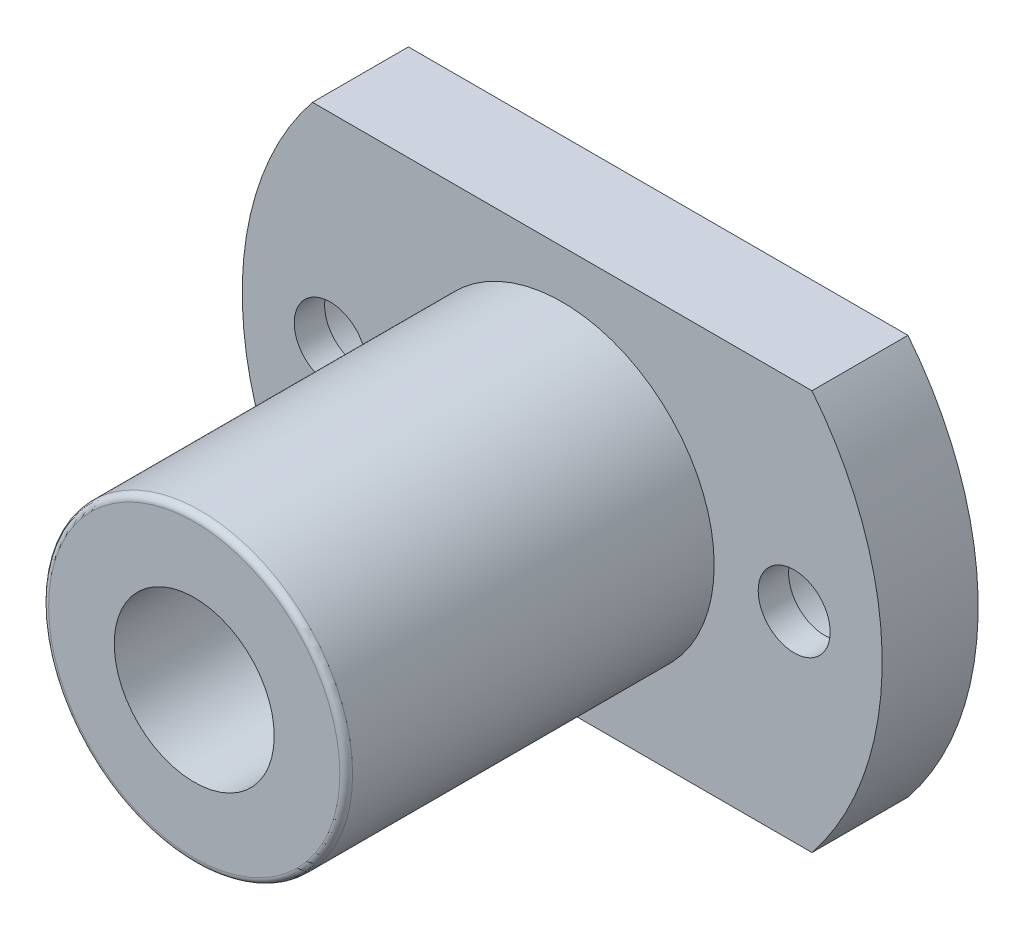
ISO-10303-21;
HEADER;
FILE_DESCRIPTION(('STEP AP214'),'2;1');
FILE_NAME('part.step','',(''),(''),'','','');
FILE_SCHEMA(('AUTOMOTIVE_DESIGN { 1 0 10303 214 1 1 1 1 }'));
ENDSEC;
DATA;
#1=APPLICATION_CONTEXT('core data for automotive mechanical design processes');
#2=APPLICATION_PROTOCOL_DEFINITION('international standard','automotive_design',2000,#1);
#3=PRODUCT_CONTEXT('',#1,'mechanical');
#4=PRODUCT('Part','Part','',(#3));
#5=PRODUCT_RELATED_PRODUCT_CATEGORY('part','',(#4));
#6=PRODUCT_DEFINITION_FORMATION('','',#4);
#7=PRODUCT_DEFINITION_CONTEXT('part definition',#1,'design');
#8=PRODUCT_DEFINITION('design','',#6,#7);
#9=PRODUCT_DEFINITION_SHAPE('','',#8);
#10=(LENGTH_UNIT() NAMED_UNIT(*) SI_UNIT(.MILLI.,.METRE.));
#11=(NAMED_UNIT(*) PLANE_ANGLE_UNIT() SI_UNIT($,.RADIAN.));
#12=(NAMED_UNIT(*) SI_UNIT($,.STERADIAN.) SOLID_ANGLE_UNIT());
#13=UNCERTAINTY_MEASURE_WITH_UNIT(LENGTH_MEASURE(1.E-05),#10,'distance_accuracy_value','');
#14=(GEOMETRIC_REPRESENTATION_CONTEXT(3) GLOBAL_UNCERTAINTY_ASSIGNED_CONTEXT((#13)) GLOBAL_UNIT_ASSIGNED_CONTEXT((#10,
#11,#12)) REPRESENTATION_CONTEXT('',''));
#15=CARTESIAN_POINT('',(0.,0.,0.));
#16=DIRECTION('',(0.,0.,1.));
#17=DIRECTION('',(1.,0.,0.));
#18=AXIS2_PLACEMENT_3D('',#15,#16,#17);
#19=CARTESIAN_POINT('',(-14.5,0.,0.));
#20=DIRECTION('',(0.,0.,1.));
#21=DIRECTION('',(1.,0.,0.));
#22=AXIS2_PLACEMENT_3D('',#19,#20,#21);
#23=CYLINDRICAL_SURFACE('',#22,3.75);
#24=CARTESIAN_POINT('',(-14.5,0.,4.1));
#25=DIRECTION('',(0.,0.,1.));
#26=DIRECTION('',(1.,0.,0.));
#27=AXIS2_PLACEMENT_3D('',#24,#25,#26);
#28=CIRCLE('',#27,3.75);
#29=CARTESIAN_POINT('',(-10.75,0.,4.1));
#30=VERTEX_POINT('',#29);
#31=EDGE_CURVE('E19',#30,#30,#28,.F.);
#32=ORIENTED_EDGE('',*,*,#31,.F.);
#33=EDGE_LOOP('',(#32));
#34=FACE_BOUND('',#33,.T.);
#35=CARTESIAN_POINT('',(-14.5,0.,0.));
#36=DIRECTION('',(0.,0.,1.));
#37=DIRECTION('',(1.,0.,0.));
#38=AXIS2_PLACEMENT_3D('',#35,#36,#37);
#39=CIRCLE('',#38,3.75);
#40=CARTESIAN_POINT('',(-10.75,0.,0.));
#41=VERTEX_POINT('',#40);
#42=EDGE_CURVE('E177',#41,#41,#39,.T.);
#43=ORIENTED_EDGE('',*,*,#42,.F.);
#44=EDGE_LOOP('',(#43));
#45=FACE_BOUND('',#44,.T.);
#46=ADVANCED_FACE('F16',(#34,#45),#23,.F.);
#47=CARTESIAN_POINT('',(14.5,0.,6.));
#48=DIRECTION('',(0.,0.,-1.));
#49=DIRECTION('',(-1.,0.,0.));
#50=AXIS2_PLACEMENT_3D('',#47,#48,#49);
#51=CYLINDRICAL_SURFACE('',#50,3.75);
#52=CARTESIAN_POINT('',(14.5,0.,0.));
#53=DIRECTION('',(0.,0.,-1.));
#54=DIRECTION('',(-1.,0.,0.));
#55=AXIS2_PLACEMENT_3D('',#52,#53,#54);
#56=CIRCLE('',#55,3.75);
#57=CARTESIAN_POINT('',(10.75,0.,0.));
#58=VERTEX_POINT('',#57);
#59=EDGE_CURVE('E172',#58,#58,#56,.F.);
#60=ORIENTED_EDGE('',*,*,#59,.F.);
#61=EDGE_LOOP('',(#60));
#62=FACE_BOUND('',#61,.T.);
#63=CARTESIAN_POINT('',(14.5,0.,4.1));
#64=DIRECTION('',(0.,0.,-1.));
#65=DIRECTION('',(-1.,0.,0.));
#66=AXIS2_PLACEMENT_3D('',#63,#64,#65);
#67=CIRCLE('',#66,3.75);
#68=CARTESIAN_POINT('',(10.75,0.,4.1));
#69=VERTEX_POINT('',#68);
#70=EDGE_CURVE('E169',#69,#69,#67,.T.);
#71=ORIENTED_EDGE('',*,*,#70,.F.);
#72=EDGE_LOOP('',(#71));
#73=FACE_BOUND('',#72,.T.);
#74=ADVANCED_FACE('F116',(#62,#73),#51,.F.);
#75=CARTESIAN_POINT('',(0.,0.,0.));
#76=DIRECTION('',(0.,0.,1.));
#77=DIRECTION('',(1.,0.,0.));
#78=AXIS2_PLACEMENT_3D('',#75,#76,#77);
#79=CYLINDRICAL_SURFACE('',#78,5.);
#80=CARTESIAN_POINT('',(0.,0.,29.));
#81=DIRECTION('',(0.,0.,1.));
#82=DIRECTION('',(1.,0.,0.));
#83=AXIS2_PLACEMENT_3D('',#80,#81,#82);
#84=CIRCLE('',#83,5.);
#85=CARTESIAN_POINT('',(5.,0.,29.));
#86=VERTEX_POINT('',#85);
#87=EDGE_CURVE('E166',#86,#86,#84,.F.);
#88=ORIENTED_EDGE('',*,*,#87,.F.);
#89=EDGE_LOOP('',(#88));
#90=FACE_BOUND('',#89,.T.);
#91=CARTESIAN_POINT('',(0.,0.,0.));
#92=DIRECTION('',(0.,0.,1.));
#93=DIRECTION('',(1.,0.,0.));
#94=AXIS2_PLACEMENT_3D('',#91,#92,#93);
#95=CIRCLE('',#94,5.);
#96=CARTESIAN_POINT('',(5.,0.,0.));
#97=VERTEX_POINT('',#96);
#98=EDGE_CURVE('E175',#97,#97,#95,.T.);
#99=ORIENTED_EDGE('',*,*,#98,.F.);
#100=EDGE_LOOP('',(#99));
#101=FACE_BOUND('',#100,.T.);
#102=ADVANCED_FACE('F113',(#90,#101),#79,.F.);
#103=CARTESIAN_POINT('',(-16.75,0.,4.1));
#104=DIRECTION('',(0.,0.,-1.));
#105=DIRECTION('',(-1.,0.,0.));
#106=AXIS2_PLACEMENT_3D('',#103,#104,#105);
#107=PLANE('',#106);
#108=CARTESIAN_POINT('',(-14.5,0.,4.1));
#109=DIRECTION('',(0.,0.,1.));
#110=DIRECTION('',(1.,0.,0.));
#111=AXIS2_PLACEMENT_3D('',#108,#109,#110);
#112=CIRCLE('',#111,2.25);
#113=CARTESIAN_POINT('',(-12.25,0.,4.1));
#114=VERTEX_POINT('',#113);
#115=EDGE_CURVE('E163',#114,#114,#112,.T.);
#116=ORIENTED_EDGE('',*,*,#115,.T.);
#117=EDGE_LOOP('',(#116));
#118=FACE_BOUND('',#117,.T.);
#119=ORIENTED_EDGE('',*,*,#31,.T.);
#120=EDGE_LOOP('',(#119));
#121=FACE_BOUND('',#120,.T.);
#122=ADVANCED_FACE('F109',(#118,#121),#107,.T.);
#123=CARTESIAN_POINT('',(-5.,0.,0.));
#124=DIRECTION('',(0.,0.,-1.));
#125=DIRECTION('',(-1.,0.,0.));
#126=AXIS2_PLACEMENT_3D('',#123,#124,#125);
#127=PLANE('',#126);
#128=ORIENTED_EDGE('',*,*,#59,.T.);
#129=EDGE_LOOP('',(#128));
#130=FACE_BOUND('',#129,.T.);
#131=DIRECTION('',(-1.,0.,0.));
#132=VECTOR('',#131,1.);
#133=CARTESIAN_POINT('',(-15.612494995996,-12.5,0.));
#134=LINE('',#133,#132);
#135=CARTESIAN_POINT('',(15.612494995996,-12.5,0.));
#136=VERTEX_POINT('',#135);
#137=CARTESIAN_POINT('',(-15.612494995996,-12.5,0.));
#138=VERTEX_POINT('',#137);
#139=EDGE_CURVE('E66',#136,#138,#134,.T.);
#140=ORIENTED_EDGE('',*,*,#139,.T.);
#141=CARTESIAN_POINT('',(0.,0.,0.));
#142=DIRECTION('',(0.,0.,1.));
#143=DIRECTION('',(1.,0.,0.));
#144=AXIS2_PLACEMENT_3D('',#141,#142,#143);
#145=CIRCLE('',#144,20.);
#146=CARTESIAN_POINT('',(-15.612494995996,12.5,0.));
#147=VERTEX_POINT('',#146);
#148=EDGE_CURVE('E55',#147,#138,#145,.T.);
#149=ORIENTED_EDGE('',*,*,#148,.F.);
#150=DIRECTION('',(1.,0.,0.));
#151=VECTOR('',#150,1.);
#152=CARTESIAN_POINT('',(15.612494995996,12.5,0.));
#153=LINE('',#152,#151);
#154=CARTESIAN_POINT('',(15.612494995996,12.5,0.));
#155=VERTEX_POINT('',#154);
#156=EDGE_CURVE('E64',#147,#155,#153,.T.);
#157=ORIENTED_EDGE('',*,*,#156,.T.);
#158=CARTESIAN_POINT('',(0.,0.,0.));
#159=DIRECTION('',(0.,0.,1.));
#160=DIRECTION('',(1.,0.,0.));
#161=AXIS2_PLACEMENT_3D('',#158,#159,#160);
#162=CIRCLE('',#161,20.);
#163=EDGE_CURVE('E70',#136,#155,#162,.T.);
#164=ORIENTED_EDGE('',*,*,#163,.F.);
#165=EDGE_LOOP('',(#140,#149,#157,#164));
#166=FACE_BOUND('',#165,.T.);
#167=ORIENTED_EDGE('',*,*,#98,.T.);
#168=EDGE_LOOP('',(#167));
#169=FACE_BOUND('',#168,.T.);
#170=ORIENTED_EDGE('',*,*,#42,.T.);
#171=EDGE_LOOP('',(#170));
#172=FACE_BOUND('',#171,.T.);
#173=ADVANCED_FACE('F67',(#130,#166,#169,#172),#127,.T.);
#174=CARTESIAN_POINT('',(18.25,0.,4.1));
#175=DIRECTION('',(0.,0.,-1.));
#176=DIRECTION('',(-1.,0.,0.));
#177=AXIS2_PLACEMENT_3D('',#174,#175,#176);
#178=PLANE('',#177);
#179=ORIENTED_EDGE('',*,*,#70,.T.);
#180=EDGE_LOOP('',(#179));
#181=FACE_BOUND('',#180,.T.);
#182=CARTESIAN_POINT('',(14.5,0.,4.1));
#183=DIRECTION('',(0.,0.,-1.));
#184=DIRECTION('',(-1.,0.,0.));
#185=AXIS2_PLACEMENT_3D('',#182,#183,#184);
#186=CIRCLE('',#185,2.25);
#187=CARTESIAN_POINT('',(12.25,0.,4.1));
#188=VERTEX_POINT('',#187);
#189=EDGE_CURVE('E158',#188,#188,#186,.F.);
#190=ORIENTED_EDGE('',*,*,#189,.T.);
#191=EDGE_LOOP('',(#190));
#192=FACE_BOUND('',#191,.T.);
#193=ADVANCED_FACE('F102',(#181,#192),#178,.T.);
#194=CARTESIAN_POINT('',(-9.1,0.,29.));
#195=DIRECTION('',(0.,0.,1.));
#196=DIRECTION('',(1.,0.,0.));
#197=AXIS2_PLACEMENT_3D('',#194,#195,#196);
#198=PLANE('',#197);
#199=CARTESIAN_POINT('',(0.,0.,29.));
#200=DIRECTION('',(0.,0.,-1.));
#201=DIRECTION('',(-1.,0.,0.));
#202=AXIS2_PLACEMENT_3D('',#199,#200,#201);
#203=CIRCLE('',#202,9.1);
#204=CARTESIAN_POINT('',(-9.1,0.,29.));
#205=VERTEX_POINT('',#204);
#206=EDGE_CURVE('E85',#205,#205,#203,.T.);
#207=ORIENTED_EDGE('',*,*,#206,.F.);
#208=EDGE_LOOP('',(#207));
#209=FACE_BOUND('',#208,.T.);
#210=ORIENTED_EDGE('',*,*,#87,.T.);
#211=EDGE_LOOP('',(#210));
#212=FACE_BOUND('',#211,.T.);
#213=ADVANCED_FACE('F91',(#209,#212),#198,.T.);
#214=CARTESIAN_POINT('',(-14.5,0.,0.));
#215=DIRECTION('',(0.,0.,1.));
#216=DIRECTION('',(1.,0.,0.));
#217=AXIS2_PLACEMENT_3D('',#214,#215,#216);
#218=CYLINDRICAL_SURFACE('',#217,2.25);
#219=CARTESIAN_POINT('',(-14.5,0.,6.));
#220=DIRECTION('',(0.,0.,1.));
#221=DIRECTION('',(1.,0.,0.));
#222=AXIS2_PLACEMENT_3D('',#219,#220,#221);
#223=CIRCLE('',#222,2.25);
#224=CARTESIAN_POINT('',(-12.25,0.,6.));
#225=VERTEX_POINT('',#224);
#226=EDGE_CURVE('E192',#225,#225,#223,.F.);
#227=ORIENTED_EDGE('',*,*,#226,.F.);
#228=EDGE_LOOP('',(#227));
#229=FACE_BOUND('',#228,.T.);
#230=ORIENTED_EDGE('',*,*,#115,.F.);
#231=EDGE_LOOP('',(#230));
#232=FACE_BOUND('',#231,.T.);
#233=ADVANCED_FACE('F101',(#229,#232),#218,.F.);
#234=CARTESIAN_POINT('',(15.612494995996,12.5,6.));
#235=DIRECTION('',(0.,-1.,0.));
#236=DIRECTION('',(1.,0.,0.));
#237=AXIS2_PLACEMENT_3D('',#234,#235,#236);
#238=PLANE('',#237);
#239=DIRECTION('',(0.,0.,1.));
#240=VECTOR('',#239,1.);
#241=CARTESIAN_POINT('',(-15.612494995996,12.5,6.));
#242=LINE('',#241,#240);
#243=CARTESIAN_POINT('',(-15.612494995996,12.5,6.));
#244=VERTEX_POINT('',#243);
#245=EDGE_CURVE('E63',#244,#147,#242,.F.);
#246=ORIENTED_EDGE('',*,*,#245,.F.);
#247=DIRECTION('',(1.,0.,0.));
#248=VECTOR('',#247,1.);
#249=CARTESIAN_POINT('',(0.,12.5,6.));
#250=LINE('',#249,#248);
#251=CARTESIAN_POINT('',(15.612494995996,12.5,6.));
#252=VERTEX_POINT('',#251);
#253=EDGE_CURVE('E151',#252,#244,#250,.F.);
#254=ORIENTED_EDGE('',*,*,#253,.F.);
#255=DIRECTION('',(0.,0.,1.));
#256=VECTOR('',#255,1.);
#257=CARTESIAN_POINT('',(15.612494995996,12.5,6.));
#258=LINE('',#257,#256);
#259=EDGE_CURVE('E153',#155,#252,#258,.T.);
#260=ORIENTED_EDGE('',*,*,#259,.F.);
#261=ORIENTED_EDGE('',*,*,#156,.F.);
#262=EDGE_LOOP('',(#246,#254,#260,#261));
#263=FACE_BOUND('',#262,.T.);
#264=ADVANCED_FACE('F214',(#263),#238,.F.);
#265=CARTESIAN_POINT('',(0.,0.,6.));
#266=DIRECTION('',(0.,0.,1.));
#267=DIRECTION('',(1.,0.,0.));
#268=AXIS2_PLACEMENT_3D('',#265,#266,#267);
#269=CYLINDRICAL_SURFACE('',#268,20.);
#270=CARTESIAN_POINT('',(0.,0.,6.));
#271=DIRECTION('',(0.,0.,1.));
#272=DIRECTION('',(1.,0.,0.));
#273=AXIS2_PLACEMENT_3D('',#270,#271,#272);
#274=CIRCLE('',#273,20.);
#275=CARTESIAN_POINT('',(-15.612494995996,-12.5,6.));
#276=VERTEX_POINT('',#275);
#277=EDGE_CURVE('E198',#244,#276,#274,.T.);
#278=ORIENTED_EDGE('',*,*,#277,.F.);
#279=ORIENTED_EDGE('',*,*,#245,.T.);
#280=ORIENTED_EDGE('',*,*,#148,.T.);
#281=DIRECTION('',(0.,0.,1.));
#282=VECTOR('',#281,1.);
#283=CARTESIAN_POINT('',(-15.612494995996,-12.5,6.));
#284=LINE('',#283,#282);
#285=EDGE_CURVE('E62',#138,#276,#284,.T.);
#286=ORIENTED_EDGE('',*,*,#285,.T.);
#287=EDGE_LOOP('',(#278,#279,#280,#286));
#288=FACE_BOUND('',#287,.T.);
#289=ADVANCED_FACE('F60',(#288),#269,.T.);
#290=CARTESIAN_POINT('',(-15.612494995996,-12.5,6.));
#291=DIRECTION('',(0.,1.,0.));
#292=DIRECTION('',(-1.,0.,0.));
#293=AXIS2_PLACEMENT_3D('',#290,#291,#292);
#294=PLANE('',#293);
#295=DIRECTION('',(0.,0.,1.));
#296=VECTOR('',#295,1.);
#297=CARTESIAN_POINT('',(15.612494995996,-12.5,6.));
#298=LINE('',#297,#296);
#299=CARTESIAN_POINT('',(15.612494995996,-12.5,6.));
#300=VERTEX_POINT('',#299);
#301=EDGE_CURVE('E34',#300,#136,#298,.F.);
#302=ORIENTED_EDGE('',*,*,#301,.F.);
#303=DIRECTION('',(1.,0.,0.));
#304=VECTOR('',#303,1.);
#305=CARTESIAN_POINT('',(0.,-12.5,6.));
#306=LINE('',#305,#304);
#307=EDGE_CURVE('E74',#276,#300,#306,.T.);
#308=ORIENTED_EDGE('',*,*,#307,.F.);
#309=ORIENTED_EDGE('',*,*,#285,.F.);
#310=ORIENTED_EDGE('',*,*,#139,.F.);
#311=EDGE_LOOP('',(#302,#308,#309,#310));
#312=FACE_BOUND('',#311,.T.);
#313=ADVANCED_FACE('F72',(#312),#294,.F.);
#314=CARTESIAN_POINT('',(0.,0.,6.));
#315=DIRECTION('',(0.,0.,1.));
#316=DIRECTION('',(1.,0.,0.));
#317=AXIS2_PLACEMENT_3D('',#314,#315,#316);
#318=CYLINDRICAL_SURFACE('',#317,20.);
#319=CARTESIAN_POINT('',(0.,0.,6.));
#320=DIRECTION('',(0.,0.,1.));
#321=DIRECTION('',(1.,0.,0.));
#322=AXIS2_PLACEMENT_3D('',#319,#320,#321);
#323=CIRCLE('',#322,20.);
#324=EDGE_CURVE('E201',#300,#252,#323,.T.);
#325=ORIENTED_EDGE('',*,*,#324,.F.);
#326=ORIENTED_EDGE('',*,*,#301,.T.);
#327=ORIENTED_EDGE('',*,*,#163,.T.);
#328=ORIENTED_EDGE('',*,*,#259,.T.);
#329=EDGE_LOOP('',(#325,#326,#327,#328));
#330=FACE_BOUND('',#329,.T.);
#331=ADVANCED_FACE('F217',(#330),#318,.T.);
#332=CARTESIAN_POINT('',(14.5,0.,6.));
#333=DIRECTION('',(0.,0.,-1.));
#334=DIRECTION('',(-1.,0.,0.));
#335=AXIS2_PLACEMENT_3D('',#332,#333,#334);
#336=CYLINDRICAL_SURFACE('',#335,2.25);
#337=ORIENTED_EDGE('',*,*,#189,.F.);
#338=EDGE_LOOP('',(#337));
#339=FACE_BOUND('',#338,.T.);
#340=CARTESIAN_POINT('',(14.5,0.,6.));
#341=DIRECTION('',(0.,0.,-1.));
#342=DIRECTION('',(-1.,0.,0.));
#343=AXIS2_PLACEMENT_3D('',#340,#341,#342);
#344=CIRCLE('',#343,2.25);
#345=CARTESIAN_POINT('',(12.25,0.,6.));
#346=VERTEX_POINT('',#345);
#347=EDGE_CURVE('E203',#346,#346,#344,.T.);
#348=ORIENTED_EDGE('',*,*,#347,.F.);
#349=EDGE_LOOP('',(#348));
#350=FACE_BOUND('',#349,.T.);
#351=ADVANCED_FACE('F146',(#339,#350),#336,.F.);
#352=CARTESIAN_POINT('',(0.,0.,28.6));
#353=DIRECTION('',(0.,0.,-1.));
#354=DIRECTION('',(-1.,0.,0.));
#355=AXIS2_PLACEMENT_3D('',#352,#353,#354);
#356=TOROIDAL_SURFACE('',#355,9.1,0.4);
#357=CARTESIAN_POINT('',(0.,0.,28.6));
#358=DIRECTION('',(0.,0.,1.));
#359=DIRECTION('',(1.,0.,0.));
#360=AXIS2_PLACEMENT_3D('',#357,#358,#359);
#361=CIRCLE('',#360,9.5);
#362=CARTESIAN_POINT('',(9.5,0.,28.6));
#363=VERTEX_POINT('',#362);
#364=EDGE_CURVE('E25',#363,#363,#361,.F.);
#365=ORIENTED_EDGE('',*,*,#364,.F.);
#366=EDGE_LOOP('',(#365));
#367=FACE_BOUND('',#366,.T.);
#368=ORIENTED_EDGE('',*,*,#206,.T.);
#369=EDGE_LOOP('',(#368));
#370=FACE_BOUND('',#369,.T.);
#371=ADVANCED_FACE('F137',(#367,#370),#356,.T.);
#372=CARTESIAN_POINT('',(0.,0.,6.));
#373=DIRECTION('',(0.,0.,1.));
#374=DIRECTION('',(1.,0.,0.));
#375=AXIS2_PLACEMENT_3D('',#372,#373,#374);
#376=PLANE('',#375);
#377=ORIENTED_EDGE('',*,*,#347,.T.);
#378=EDGE_LOOP('',(#377));
#379=FACE_BOUND('',#378,.T.);
#380=ORIENTED_EDGE('',*,*,#307,.T.);
#381=ORIENTED_EDGE('',*,*,#324,.T.);
#382=ORIENTED_EDGE('',*,*,#253,.T.);
#383=ORIENTED_EDGE('',*,*,#277,.T.);
#384=EDGE_LOOP('',(#380,#381,#382,#383));
#385=FACE_BOUND('',#384,.T.);
#386=CARTESIAN_POINT('',(0.,0.,6.));
#387=DIRECTION('',(0.,0.,1.));
#388=DIRECTION('',(1.,0.,0.));
#389=AXIS2_PLACEMENT_3D('',#386,#387,#388);
#390=CIRCLE('',#389,9.5);
#391=CARTESIAN_POINT('',(9.5,0.,6.));
#392=VERTEX_POINT('',#391);
#393=EDGE_CURVE('E11',#392,#392,#390,.T.);
#394=ORIENTED_EDGE('',*,*,#393,.F.);
#395=EDGE_LOOP('',(#394));
#396=FACE_BOUND('',#395,.T.);
#397=ORIENTED_EDGE('',*,*,#226,.T.);
#398=EDGE_LOOP('',(#397));
#399=FACE_BOUND('',#398,.T.);
#400=ADVANCED_FACE('F130',(#379,#385,#396,#399),#376,.T.);
#401=CARTESIAN_POINT('',(0.,0.,0.));
#402=DIRECTION('',(0.,0.,1.));
#403=DIRECTION('',(1.,0.,0.));
#404=AXIS2_PLACEMENT_3D('',#401,#402,#403);
#405=CYLINDRICAL_SURFACE('',#404,9.5);
#406=ORIENTED_EDGE('',*,*,#393,.T.);
#407=EDGE_LOOP('',(#406));
#408=FACE_BOUND('',#407,.T.);
#409=ORIENTED_EDGE('',*,*,#364,.T.);
#410=EDGE_LOOP('',(#409));
#411=FACE_BOUND('',#410,.T.);
#412=ADVANCED_FACE('F128',(#408,#411),#405,.T.);
#413=CLOSED_SHELL('',(#46,#74,#102,#122,#173,#193,#213,#233,#264,#289,#313,#331,#351,#371,#400,#412));
#414=MANIFOLD_SOLID_BREP('B1',#413);
#415=ADVANCED_BREP_SHAPE_REPRESENTATION('',(#18,#414),#14);
#416=SHAPE_DEFINITION_REPRESENTATION(#9,#415);
ENDSEC;
END-ISO-10303-21;
